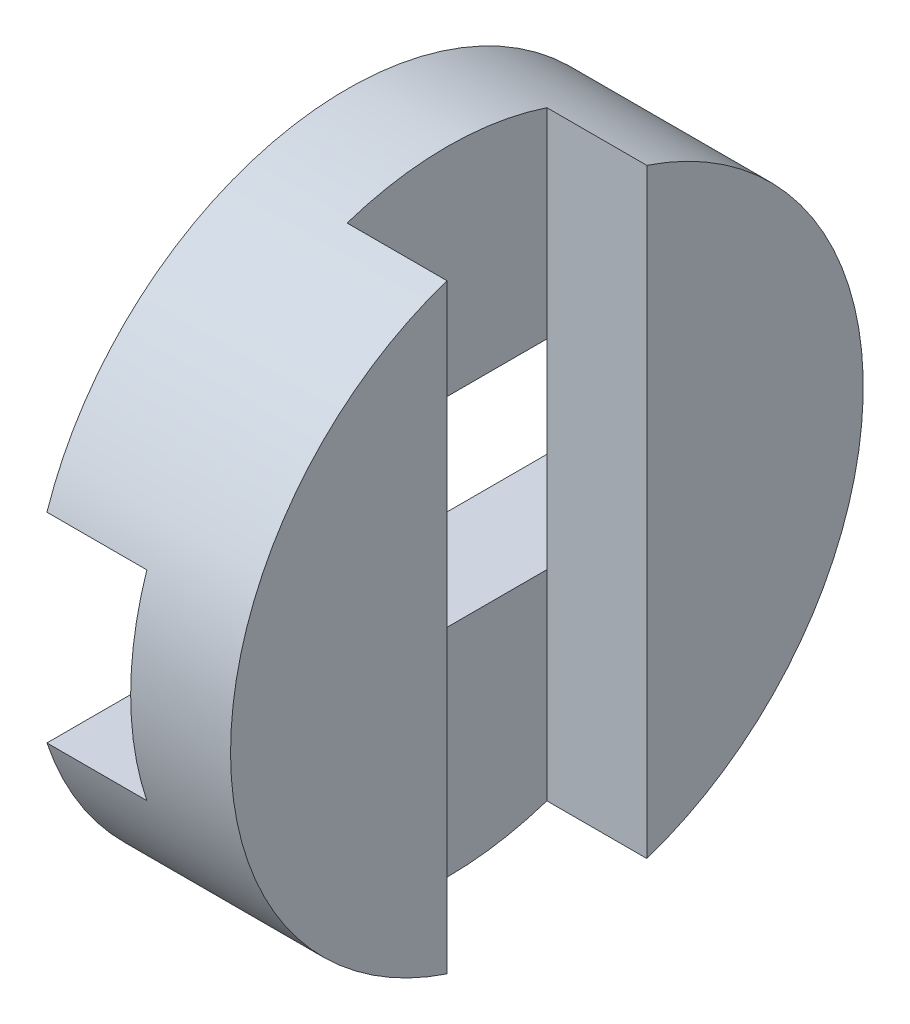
from build123d import *

# Parameters (mm, degrees)
ESQUISSE1_W             = 6
ESQUISSE1_H             = 9.5
ESQUISSE2_W             = 3
ESQUISSE2_H             = 6
ENL_V_MAT_EXTRU_1_DEPTH = 10
ESQUISSE3_W             = 3
ESQUISSE3_H             = 6
ENL_V_MAT_EXTRU_2_DEPTH = 10


with BuildPart() as part:
    # Esquisse1 → Base-R_volution (revolve)
    with BuildSketch(Plane.XY, mode=Mode.PRIVATE) as base_r_volution_sk:
        with Locations((3, 4.75)):
            Rectangle(ESQUISSE1_W, ESQUISSE1_H)
    revolve(base_r_volution_sk.sketch.rotate(Axis((0, 0, 0), (1, 0, 0)), 71.591519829), axis=Axis((0, 0, 0), (1, 0, 0)))

    # Esquisse2 → Enl_v. mat.-Extru.1 (cut, symmetric)
    with BuildSketch(Plane.XY):
        with Locations((1.5, 0)):
            Rectangle(ESQUISSE2_W, ESQUISSE2_H)
    extrude(amount=ENL_V_MAT_EXTRU_1_DEPTH, both=True, mode=Mode.SUBTRACT)

    # Esquisse3 → Enl_v. mat.-Extru.2 (cut, symmetric)
    with BuildSketch(Plane(origin=(0, 0, 0), x_dir=(1, 0, 0), z_dir=(0, 1, 0))):
        with Locations((4.5, 0)):
            Rectangle(ESQUISSE3_W, ESQUISSE3_H)
    extrude(amount=ENL_V_MAT_EXTRU_2_DEPTH, both=True, mode=Mode.SUBTRACT)


solid = part.part
